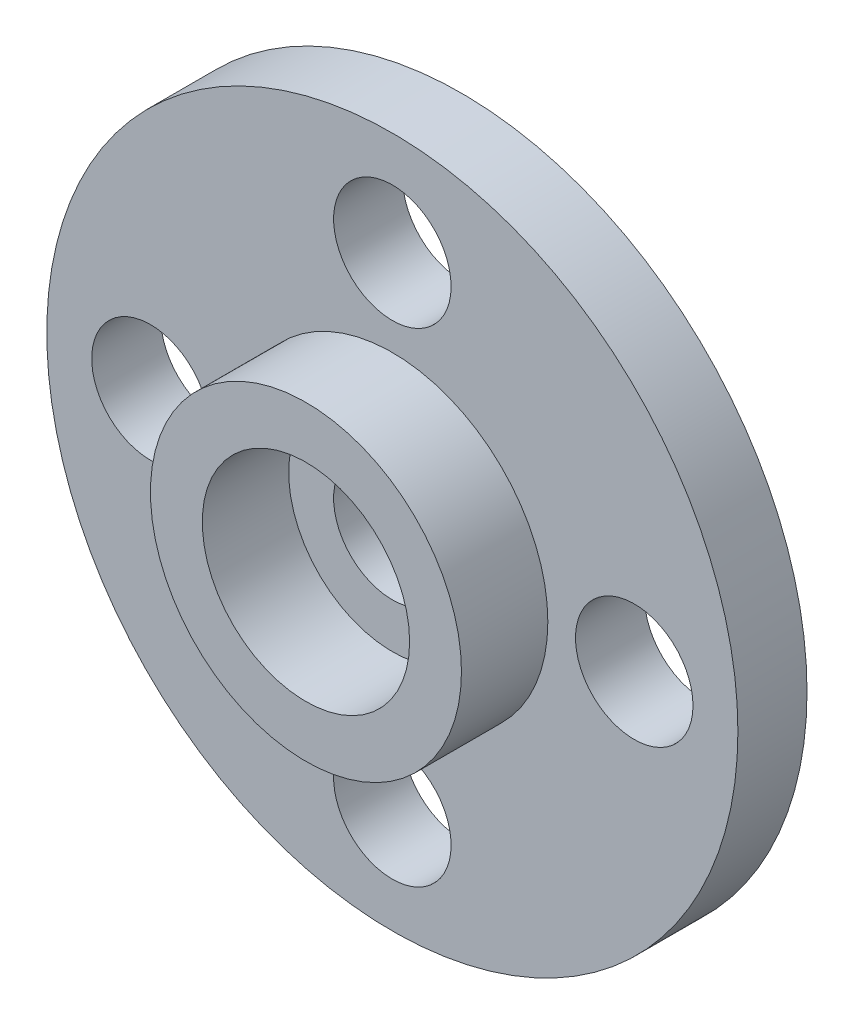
from build123d import *

# Parameters (mm, degrees)
SKETCH1_R            = 10
BOSS_EXTRUDE1_DEPTH  = 2
M3_CLEARANCE_HOLE1_D = 3.4
SKETCH4_R            = 4.5
SKETCH4_R_2          = 3
EXTRUDE_THIN1_DEPTH  = 2.5


with BuildPart() as part:
    # Sketch1 → Boss-Extrude1 (new body)
    with BuildSketch(Plane.XY):
        Circle(SKETCH1_R)
    extrude(amount=BOSS_EXTRUDE1_DEPTH)

    # M3 Clearance Hole1 (through all)
    with Locations(Plane.XY.offset(2)):
        with Locations((-7, 0), (7, 0), (0, 7), (0, -7), (0, 0)):
            Hole(M3_CLEARANCE_HOLE1_D / 2)

    # Sketch4 → Extrude-Thin1 (add)
    with BuildSketch(Plane.XY.offset(2)):
        Circle(SKETCH4_R)
        Circle(SKETCH4_R_2, mode=Mode.SUBTRACT)
    extrude(amount=EXTRUDE_THIN1_DEPTH)


solid = part.part
